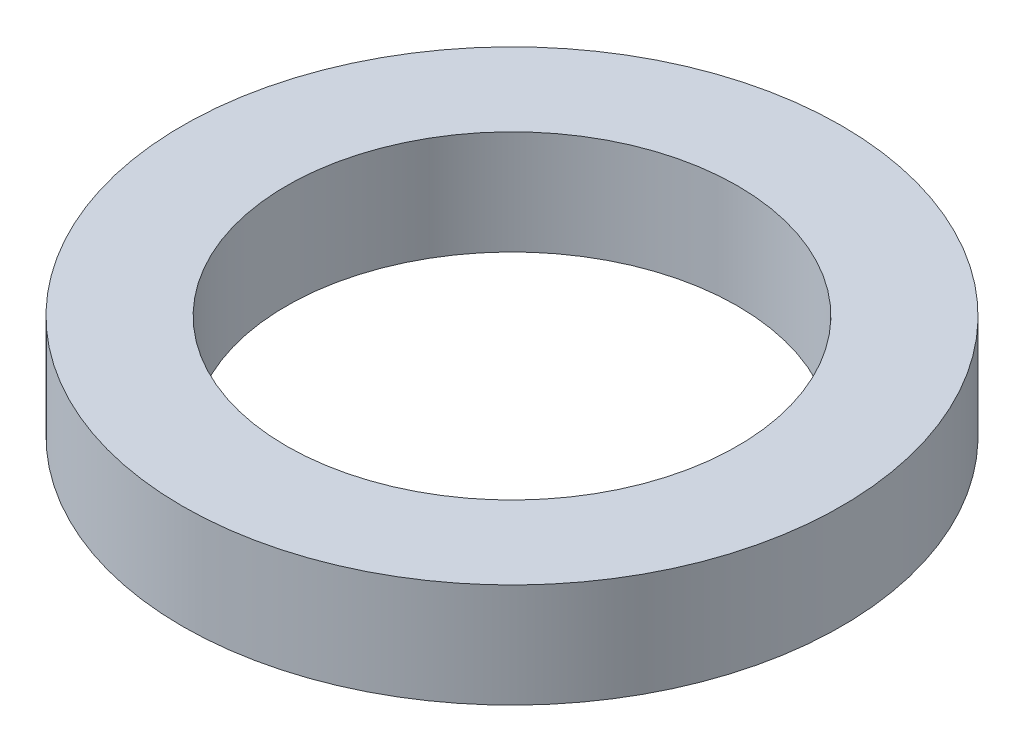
ISO-10303-21;
HEADER;
FILE_DESCRIPTION(('STEP AP214'),'2;1');
FILE_NAME('part.step','',(''),(''),'','','');
FILE_SCHEMA(('AUTOMOTIVE_DESIGN { 1 0 10303 214 1 1 1 1 }'));
ENDSEC;
DATA;
#1=APPLICATION_CONTEXT('core data for automotive mechanical design processes');
#2=APPLICATION_PROTOCOL_DEFINITION('international standard','automotive_design',2000,#1);
#3=PRODUCT_CONTEXT('',#1,'mechanical');
#4=PRODUCT('Part','Part','',(#3));
#5=PRODUCT_RELATED_PRODUCT_CATEGORY('part','',(#4));
#6=PRODUCT_DEFINITION_FORMATION('','',#4);
#7=PRODUCT_DEFINITION_CONTEXT('part definition',#1,'design');
#8=PRODUCT_DEFINITION('design','',#6,#7);
#9=PRODUCT_DEFINITION_SHAPE('','',#8);
#10=(LENGTH_UNIT() NAMED_UNIT(*) SI_UNIT(.MILLI.,.METRE.));
#11=(NAMED_UNIT(*) PLANE_ANGLE_UNIT() SI_UNIT($,.RADIAN.));
#12=(NAMED_UNIT(*) SI_UNIT($,.STERADIAN.) SOLID_ANGLE_UNIT());
#13=UNCERTAINTY_MEASURE_WITH_UNIT(LENGTH_MEASURE(1.E-05),#10,'distance_accuracy_value','');
#14=(GEOMETRIC_REPRESENTATION_CONTEXT(3) GLOBAL_UNCERTAINTY_ASSIGNED_CONTEXT((#13)) GLOBAL_UNIT_ASSIGNED_CONTEXT((#10,
#11,#12)) REPRESENTATION_CONTEXT('',''));
#15=CARTESIAN_POINT('',(0.,0.,0.));
#16=DIRECTION('',(0.,0.,1.));
#17=DIRECTION('',(1.,0.,0.));
#18=AXIS2_PLACEMENT_3D('',#15,#16,#17);
#19=CARTESIAN_POINT('',(0.,0.,0.));
#20=DIRECTION('',(0.,-1.,0.));
#21=DIRECTION('',(0.,0.,-1.));
#22=AXIS2_PLACEMENT_3D('',#19,#20,#21);
#23=CYLINDRICAL_SURFACE('',#22,1.651);
#24=CARTESIAN_POINT('',(0.,0.762,0.));
#25=DIRECTION('',(0.,-1.,0.));
#26=DIRECTION('',(0.,0.,-1.));
#27=AXIS2_PLACEMENT_3D('',#24,#25,#26);
#28=CIRCLE('',#27,1.651);
#29=CARTESIAN_POINT('',(0.,0.762,-1.651));
#30=VERTEX_POINT('',#29);
#31=EDGE_CURVE('E43',#30,#30,#28,.T.);
#32=ORIENTED_EDGE('',*,*,#31,.F.);
#33=EDGE_LOOP('',(#32));
#34=FACE_BOUND('',#33,.T.);
#35=CARTESIAN_POINT('',(0.,0.,0.));
#36=DIRECTION('',(0.,-1.,0.));
#37=DIRECTION('',(0.,0.,-1.));
#38=AXIS2_PLACEMENT_3D('',#35,#36,#37);
#39=CIRCLE('',#38,1.651);
#40=CARTESIAN_POINT('',(0.,0.,-1.651));
#41=VERTEX_POINT('',#40);
#42=EDGE_CURVE('E10',#41,#41,#39,.T.);
#43=ORIENTED_EDGE('',*,*,#42,.T.);
#44=EDGE_LOOP('',(#43));
#45=FACE_BOUND('',#44,.T.);
#46=ADVANCED_FACE('F29',(#34,#45),#23,.F.);
#47=CARTESIAN_POINT('',(-1.651,0.,0.));
#48=DIRECTION('',(0.,1.,0.));
#49=DIRECTION('',(0.,0.,1.));
#50=AXIS2_PLACEMENT_3D('',#47,#48,#49);
#51=PLANE('',#50);
#52=ORIENTED_EDGE('',*,*,#42,.F.);
#53=EDGE_LOOP('',(#52));
#54=FACE_BOUND('',#53,.T.);
#55=CARTESIAN_POINT('',(0.,0.,0.));
#56=DIRECTION('',(0.,-1.,0.));
#57=DIRECTION('',(0.,0.,-1.));
#58=AXIS2_PLACEMENT_3D('',#55,#56,#57);
#59=CIRCLE('',#58,2.413);
#60=CARTESIAN_POINT('',(0.,0.,-2.413));
#61=VERTEX_POINT('',#60);
#62=EDGE_CURVE('E35',#61,#61,#59,.T.);
#63=ORIENTED_EDGE('',*,*,#62,.T.);
#64=EDGE_LOOP('',(#63));
#65=FACE_BOUND('',#64,.T.);
#66=ADVANCED_FACE('F52',(#54,#65),#51,.F.);
#67=CARTESIAN_POINT('',(0.,0.,0.));
#68=DIRECTION('',(0.,-1.,0.));
#69=DIRECTION('',(0.,0.,-1.));
#70=AXIS2_PLACEMENT_3D('',#67,#68,#69);
#71=CYLINDRICAL_SURFACE('',#70,2.413);
#72=ORIENTED_EDGE('',*,*,#62,.F.);
#73=EDGE_LOOP('',(#72));
#74=FACE_BOUND('',#73,.T.);
#75=CARTESIAN_POINT('',(0.,0.762,0.));
#76=DIRECTION('',(0.,-1.,0.));
#77=DIRECTION('',(0.,0.,-1.));
#78=AXIS2_PLACEMENT_3D('',#75,#76,#77);
#79=CIRCLE('',#78,2.413);
#80=CARTESIAN_POINT('',(0.,0.762,-2.413));
#81=VERTEX_POINT('',#80);
#82=EDGE_CURVE('E39',#81,#81,#79,.T.);
#83=ORIENTED_EDGE('',*,*,#82,.T.);
#84=EDGE_LOOP('',(#83));
#85=FACE_BOUND('',#84,.T.);
#86=ADVANCED_FACE('F56',(#74,#85),#71,.T.);
#87=CARTESIAN_POINT('',(-2.413,0.762,0.));
#88=DIRECTION('',(0.,-1.,0.));
#89=DIRECTION('',(0.,0.,-1.));
#90=AXIS2_PLACEMENT_3D('',#87,#88,#89);
#91=PLANE('',#90);
#92=ORIENTED_EDGE('',*,*,#82,.F.);
#93=EDGE_LOOP('',(#92));
#94=FACE_BOUND('',#93,.T.);
#95=ORIENTED_EDGE('',*,*,#31,.T.);
#96=EDGE_LOOP('',(#95));
#97=FACE_BOUND('',#96,.T.);
#98=ADVANCED_FACE('F49',(#94,#97),#91,.F.);
#99=CLOSED_SHELL('',(#46,#66,#86,#98));
#100=MANIFOLD_SOLID_BREP('B2',#99);
#101=ADVANCED_BREP_SHAPE_REPRESENTATION('',(#18,#100),#14);
#102=SHAPE_DEFINITION_REPRESENTATION(#9,#101);
ENDSEC;
END-ISO-10303-21;
